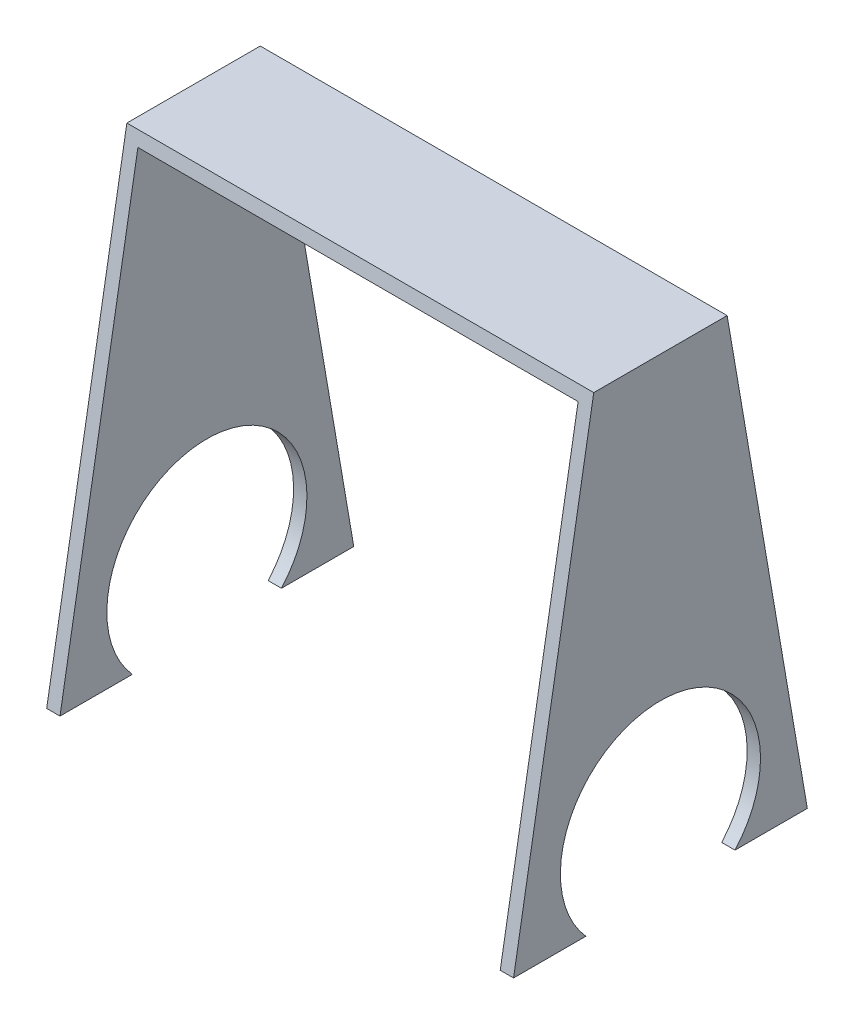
ISO-10303-21;
HEADER;
FILE_DESCRIPTION(('STEP AP214'),'2;1');
FILE_NAME('part.step','',(''),(''),'','','');
FILE_SCHEMA(('AUTOMOTIVE_DESIGN { 1 0 10303 214 1 1 1 1 }'));
ENDSEC;
DATA;
#1=APPLICATION_CONTEXT('core data for automotive mechanical design processes');
#2=APPLICATION_PROTOCOL_DEFINITION('international standard','automotive_design',2000,#1);
#3=PRODUCT_CONTEXT('',#1,'mechanical');
#4=PRODUCT('Part','Part','',(#3));
#5=PRODUCT_RELATED_PRODUCT_CATEGORY('part','',(#4));
#6=PRODUCT_DEFINITION_FORMATION('','',#4);
#7=PRODUCT_DEFINITION_CONTEXT('part definition',#1,'design');
#8=PRODUCT_DEFINITION('design','',#6,#7);
#9=PRODUCT_DEFINITION_SHAPE('','',#8);
#10=(LENGTH_UNIT() NAMED_UNIT(*) SI_UNIT(.MILLI.,.METRE.));
#11=(NAMED_UNIT(*) PLANE_ANGLE_UNIT() SI_UNIT($,.RADIAN.));
#12=(NAMED_UNIT(*) SI_UNIT($,.STERADIAN.) SOLID_ANGLE_UNIT());
#13=UNCERTAINTY_MEASURE_WITH_UNIT(LENGTH_MEASURE(1.E-05),#10,'distance_accuracy_value','');
#14=(GEOMETRIC_REPRESENTATION_CONTEXT(3) GLOBAL_UNCERTAINTY_ASSIGNED_CONTEXT((#13)) GLOBAL_UNIT_ASSIGNED_CONTEXT((#10,
#11,#12)) REPRESENTATION_CONTEXT('',''));
#15=CARTESIAN_POINT('',(0.,0.,0.));
#16=DIRECTION('',(0.,0.,1.));
#17=DIRECTION('',(1.,0.,0.));
#18=AXIS2_PLACEMENT_3D('',#15,#16,#17);
#19=CARTESIAN_POINT('',(-29.8,43.,4.5));
#20=DIRECTION('',(0.,1.,0.));
#21=DIRECTION('',(0.,0.,1.));
#22=AXIS2_PLACEMENT_3D('',#19,#20,#21);
#23=PLANE('',#22);
#24=DIRECTION('',(1.,0.,0.));
#25=VECTOR('',#24,1.);
#26=CARTESIAN_POINT('',(-29.8,43.,4.45211569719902));
#27=LINE('',#26,#25);
#28=CARTESIAN_POINT('',(-30.,43.,4.45211569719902));
#29=VERTEX_POINT('',#28);
#30=CARTESIAN_POINT('',(-29.8,43.,4.45211569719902));
#31=VERTEX_POINT('',#30);
#32=EDGE_CURVE('E192',#29,#31,#27,.T.);
#33=ORIENTED_EDGE('',*,*,#32,.F.);
#34=DIRECTION('',(0.,0.,-1.));
#35=VECTOR('',#34,1.);
#36=CARTESIAN_POINT('',(-30.,43.,4.5));
#37=LINE('',#36,#35);
#38=CARTESIAN_POINT('',(-30.,43.,3.3680339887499));
#39=VERTEX_POINT('',#38);
#40=EDGE_CURVE('E160',#29,#39,#37,.T.);
#41=ORIENTED_EDGE('',*,*,#40,.T.);
#42=DIRECTION('',(1.,0.,0.));
#43=VECTOR('',#42,1.);
#44=CARTESIAN_POINT('',(-30.,43.,3.3680339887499));
#45=LINE('',#44,#43);
#46=CARTESIAN_POINT('',(-29.8,43.,3.3680339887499));
#47=VERTEX_POINT('',#46);
#48=EDGE_CURVE('E138',#39,#47,#45,.T.);
#49=ORIENTED_EDGE('',*,*,#48,.T.);
#50=DIRECTION('',(0.,0.,-1.));
#51=VECTOR('',#50,1.);
#52=CARTESIAN_POINT('',(-29.8,43.,4.5));
#53=LINE('',#52,#51);
#54=EDGE_CURVE('E157',#31,#47,#53,.T.);
#55=ORIENTED_EDGE('',*,*,#54,.F.);
#56=EDGE_LOOP('',(#33,#41,#49,#55));
#57=FACE_BOUND('',#56,.T.);
#58=ADVANCED_FACE('F32',(#57),#23,.F.);
#59=CARTESIAN_POINT('',(-23.,43.,4.5));
#60=DIRECTION('',(0.,1.,0.));
#61=DIRECTION('',(0.,0.,1.));
#62=AXIS2_PLACEMENT_3D('',#59,#60,#61);
#63=PLANE('',#62);
#64=DIRECTION('',(1.,0.,0.));
#65=VECTOR('',#64,1.);
#66=CARTESIAN_POINT('',(-23.,43.,4.45211569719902));
#67=LINE('',#66,#65);
#68=CARTESIAN_POINT('',(-23.2,43.,4.45211569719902));
#69=VERTEX_POINT('',#68);
#70=CARTESIAN_POINT('',(-23.,43.,4.45211569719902));
#71=VERTEX_POINT('',#70);
#72=EDGE_CURVE('E55',#69,#71,#67,.T.);
#73=ORIENTED_EDGE('',*,*,#72,.F.);
#74=DIRECTION('',(0.,0.,-1.));
#75=VECTOR('',#74,1.);
#76=CARTESIAN_POINT('',(-23.2,43.,4.5));
#77=LINE('',#76,#75);
#78=CARTESIAN_POINT('',(-23.2,43.,3.3680339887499));
#79=VERTEX_POINT('',#78);
#80=EDGE_CURVE('E148',#69,#79,#77,.T.);
#81=ORIENTED_EDGE('',*,*,#80,.T.);
#82=DIRECTION('',(1.,0.,0.));
#83=VECTOR('',#82,1.);
#84=CARTESIAN_POINT('',(-30.,43.,3.3680339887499));
#85=LINE('',#84,#83);
#86=CARTESIAN_POINT('',(-23.,43.,3.3680339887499));
#87=VERTEX_POINT('',#86);
#88=EDGE_CURVE('E202',#79,#87,#85,.T.);
#89=ORIENTED_EDGE('',*,*,#88,.T.);
#90=DIRECTION('',(0.,0.,-1.));
#91=VECTOR('',#90,1.);
#92=CARTESIAN_POINT('',(-23.,43.,4.5));
#93=LINE('',#92,#91);
#94=EDGE_CURVE('E140',#71,#87,#93,.T.);
#95=ORIENTED_EDGE('',*,*,#94,.F.);
#96=EDGE_LOOP('',(#73,#81,#89,#95));
#97=FACE_BOUND('',#96,.T.);
#98=ADVANCED_FACE('F237',(#97),#63,.F.);
#99=CARTESIAN_POINT('',(-30.,50.,4.5));
#100=DIRECTION('',(0.,-1.,0.));
#101=DIRECTION('',(0.,0.,-1.));
#102=AXIS2_PLACEMENT_3D('',#99,#100,#101);
#103=PLANE('',#102);
#104=DIRECTION('',(1.,0.,0.));
#105=VECTOR('',#104,1.);
#106=CARTESIAN_POINT('',(-30.,50.,3.25));
#107=LINE('',#106,#105);
#108=CARTESIAN_POINT('',(-30.,50.,3.25));
#109=VERTEX_POINT('',#108);
#110=CARTESIAN_POINT('',(-23.,50.,3.25));
#111=VERTEX_POINT('',#110);
#112=EDGE_CURVE('E121',#109,#111,#107,.T.);
#113=ORIENTED_EDGE('',*,*,#112,.T.);
#114=DIRECTION('',(0.,0.,-1.));
#115=VECTOR('',#114,1.);
#116=CARTESIAN_POINT('',(-23.,50.,4.5));
#117=LINE('',#116,#115);
#118=CARTESIAN_POINT('',(-23.,50.,1.24999999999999));
#119=VERTEX_POINT('',#118);
#120=EDGE_CURVE('E131',#111,#119,#117,.T.);
#121=ORIENTED_EDGE('',*,*,#120,.T.);
#122=DIRECTION('',(1.,0.,0.));
#123=VECTOR('',#122,1.);
#124=CARTESIAN_POINT('',(-30.,50.,1.25));
#125=LINE('',#124,#123);
#126=CARTESIAN_POINT('',(-30.,50.,1.25));
#127=VERTEX_POINT('',#126);
#128=EDGE_CURVE('E47',#127,#119,#125,.T.);
#129=ORIENTED_EDGE('',*,*,#128,.F.);
#130=DIRECTION('',(0.,0.,-1.));
#131=VECTOR('',#130,1.);
#132=CARTESIAN_POINT('',(-30.,50.,4.5));
#133=LINE('',#132,#131);
#134=EDGE_CURVE('E40',#109,#127,#133,.T.);
#135=ORIENTED_EDGE('',*,*,#134,.F.);
#136=EDGE_LOOP('',(#113,#121,#129,#135));
#137=FACE_BOUND('',#136,.T.);
#138=ADVANCED_FACE('F34',(#137),#103,.F.);
#139=CARTESIAN_POINT('',(-30.,50.,4.5));
#140=DIRECTION('',(1.,0.,0.));
#141=DIRECTION('',(0.,0.,-1.));
#142=AXIS2_PLACEMENT_3D('',#139,#140,#141);
#143=PLANE('',#142);
#144=DIRECTION('',(0.,-0.985572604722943,0.169253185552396));
#145=VECTOR('',#144,1.);
#146=CARTESIAN_POINT('',(-30.,50.,3.25));
#147=LINE('',#146,#145);
#148=EDGE_CURVE('E168',#109,#29,#147,.T.);
#149=ORIENTED_EDGE('',*,*,#148,.F.);
#150=ORIENTED_EDGE('',*,*,#134,.T.);
#151=DIRECTION('',(0.,0.985572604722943,0.169253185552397));
#152=VECTOR('',#151,1.);
#153=CARTESIAN_POINT('',(-30.,42.7211665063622,0.));
#154=LINE('',#153,#152);
#155=CARTESIAN_POINT('',(-30.,43.,0.0478843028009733));
#156=VERTEX_POINT('',#155);
#157=EDGE_CURVE('E165',#156,#127,#154,.T.);
#158=ORIENTED_EDGE('',*,*,#157,.F.);
#159=CARTESIAN_POINT('',(-30.,43.,1.1319660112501));
#160=VERTEX_POINT('',#159);
#161=EDGE_CURVE('E159',#160,#156,#37,.T.);
#162=ORIENTED_EDGE('',*,*,#161,.F.);
#163=CARTESIAN_POINT('',(-30.,44.,2.25));
#164=DIRECTION('',(1.,0.,0.));
#165=DIRECTION('',(0.,0.,-1.));
#166=AXIS2_PLACEMENT_3D('',#163,#164,#165);
#167=CIRCLE('',#166,1.5);
#168=EDGE_CURVE('E194',#160,#39,#167,.T.);
#169=ORIENTED_EDGE('',*,*,#168,.T.);
#170=ORIENTED_EDGE('',*,*,#40,.F.);
#171=EDGE_LOOP('',(#149,#150,#158,#162,#169,#170));
#172=FACE_BOUND('',#171,.T.);
#173=ADVANCED_FACE('F163',(#172),#143,.F.);
#174=DIRECTION('',(-1.,0.,0.));
#175=VECTOR('',#174,1.);
#176=CARTESIAN_POINT('',(-29.8,43.,0.0478843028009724));
#177=LINE('',#176,#175);
#178=CARTESIAN_POINT('',(-29.8,43.,0.0478843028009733));
#179=VERTEX_POINT('',#178);
#180=EDGE_CURVE('E183',#179,#156,#177,.T.);
#181=ORIENTED_EDGE('',*,*,#180,.F.);
#182=CARTESIAN_POINT('',(-29.8,43.,1.1319660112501));
#183=VERTEX_POINT('',#182);
#184=EDGE_CURVE('E156',#183,#179,#53,.T.);
#185=ORIENTED_EDGE('',*,*,#184,.F.);
#186=DIRECTION('',(1.,0.,0.));
#187=VECTOR('',#186,1.);
#188=CARTESIAN_POINT('',(-30.,43.,1.1319660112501));
#189=LINE('',#188,#187);
#190=EDGE_CURVE('E143',#183,#160,#189,.F.);
#191=ORIENTED_EDGE('',*,*,#190,.T.);
#192=ORIENTED_EDGE('',*,*,#161,.T.);
#193=EDGE_LOOP('',(#181,#185,#191,#192));
#194=FACE_BOUND('',#193,.T.);
#195=ADVANCED_FACE('F211',(#194),#23,.F.);
#196=CARTESIAN_POINT('',(-29.8,49.8,4.5));
#197=DIRECTION('',(-1.,0.,0.));
#198=DIRECTION('',(0.,0.,1.));
#199=AXIS2_PLACEMENT_3D('',#196,#197,#198);
#200=PLANE('',#199);
#201=DIRECTION('',(0.,0.985572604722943,-0.169253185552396));
#202=VECTOR('',#201,1.);
#203=CARTESIAN_POINT('',(-29.8,49.5972151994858,3.31917056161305));
#204=LINE('',#203,#202);
#205=CARTESIAN_POINT('',(-29.8,49.8,3.28434616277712));
#206=VERTEX_POINT('',#205);
#207=EDGE_CURVE('E189',#31,#206,#204,.T.);
#208=ORIENTED_EDGE('',*,*,#207,.F.);
#209=ORIENTED_EDGE('',*,*,#54,.T.);
#210=CARTESIAN_POINT('',(-29.8,44.,2.25));
#211=DIRECTION('',(-1.,0.,0.));
#212=DIRECTION('',(0.,0.,1.));
#213=AXIS2_PLACEMENT_3D('',#210,#211,#212);
#214=CIRCLE('',#213,1.5);
#215=EDGE_CURVE('E205',#47,#183,#214,.T.);
#216=ORIENTED_EDGE('',*,*,#215,.T.);
#217=ORIENTED_EDGE('',*,*,#184,.T.);
#218=DIRECTION('',(0.,-0.985572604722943,-0.169253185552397));
#219=VECTOR('',#218,1.);
#220=CARTESIAN_POINT('',(-29.8,50.3478660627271,1.3097393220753));
#221=LINE('',#220,#219);
#222=CARTESIAN_POINT('',(-29.8,49.8,1.21565383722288));
#223=VERTEX_POINT('',#222);
#224=EDGE_CURVE('E181',#223,#179,#221,.T.);
#225=ORIENTED_EDGE('',*,*,#224,.F.);
#226=DIRECTION('',(0.,0.,-1.));
#227=VECTOR('',#226,1.);
#228=CARTESIAN_POINT('',(-29.8,49.8,4.5));
#229=LINE('',#228,#227);
#230=EDGE_CURVE('E153',#206,#223,#229,.T.);
#231=ORIENTED_EDGE('',*,*,#230,.F.);
#232=EDGE_LOOP('',(#208,#209,#216,#217,#225,#231));
#233=FACE_BOUND('',#232,.T.);
#234=ADVANCED_FACE('F223',(#233),#200,.F.);
#235=CARTESIAN_POINT('',(-23.2,49.8,4.5));
#236=DIRECTION('',(0.,1.,0.));
#237=DIRECTION('',(-1.,0.,0.));
#238=AXIS2_PLACEMENT_3D('',#235,#236,#237);
#239=PLANE('',#238);
#240=DIRECTION('',(1.,0.,0.));
#241=VECTOR('',#240,1.);
#242=CARTESIAN_POINT('',(-23.2,49.8,3.28434616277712));
#243=LINE('',#242,#241);
#244=CARTESIAN_POINT('',(-23.2,49.8,3.28434616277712));
#245=VERTEX_POINT('',#244);
#246=EDGE_CURVE('E187',#206,#245,#243,.T.);
#247=ORIENTED_EDGE('',*,*,#246,.F.);
#248=ORIENTED_EDGE('',*,*,#230,.T.);
#249=DIRECTION('',(-1.,0.,0.));
#250=VECTOR('',#249,1.);
#251=CARTESIAN_POINT('',(-23.2,49.8,1.21565383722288));
#252=LINE('',#251,#250);
#253=CARTESIAN_POINT('',(-23.2,49.8,1.21565383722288));
#254=VERTEX_POINT('',#253);
#255=EDGE_CURVE('E179',#254,#223,#252,.T.);
#256=ORIENTED_EDGE('',*,*,#255,.F.);
#257=DIRECTION('',(0.,0.,-1.));
#258=VECTOR('',#257,1.);
#259=CARTESIAN_POINT('',(-23.2,49.8,4.5));
#260=LINE('',#259,#258);
#261=EDGE_CURVE('E150',#245,#254,#260,.T.);
#262=ORIENTED_EDGE('',*,*,#261,.F.);
#263=EDGE_LOOP('',(#247,#248,#256,#262));
#264=FACE_BOUND('',#263,.T.);
#265=ADVANCED_FACE('F227',(#264),#239,.F.);
#266=CARTESIAN_POINT('',(-23.2,43.,4.5));
#267=DIRECTION('',(1.,0.,0.));
#268=DIRECTION('',(0.,0.,-1.));
#269=AXIS2_PLACEMENT_3D('',#266,#267,#268);
#270=PLANE('',#269);
#271=DIRECTION('',(0.,-0.985572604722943,0.169253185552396));
#272=VECTOR('',#271,1.);
#273=CARTESIAN_POINT('',(-23.2,42.9920123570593,4.45348742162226));
#274=LINE('',#273,#272);
#275=EDGE_CURVE('E185',#245,#69,#274,.T.);
#276=ORIENTED_EDGE('',*,*,#275,.F.);
#277=ORIENTED_EDGE('',*,*,#261,.T.);
#278=DIRECTION('',(0.,0.985572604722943,0.169253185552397));
#279=VECTOR('',#278,1.);
#280=CARTESIAN_POINT('',(-23.2,43.7426632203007,0.175422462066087));
#281=LINE('',#280,#279);
#282=CARTESIAN_POINT('',(-23.2,43.,0.0478843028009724));
#283=VERTEX_POINT('',#282);
#284=EDGE_CURVE('E177',#283,#254,#281,.T.);
#285=ORIENTED_EDGE('',*,*,#284,.F.);
#286=CARTESIAN_POINT('',(-23.2,43.,1.1319660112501));
#287=VERTEX_POINT('',#286);
#288=EDGE_CURVE('E147',#287,#283,#77,.T.);
#289=ORIENTED_EDGE('',*,*,#288,.F.);
#290=CARTESIAN_POINT('',(-23.2,44.,2.25));
#291=DIRECTION('',(1.,0.,0.));
#292=DIRECTION('',(0.,0.,-1.));
#293=AXIS2_PLACEMENT_3D('',#290,#291,#292);
#294=CIRCLE('',#293,1.5);
#295=EDGE_CURVE('E199',#287,#79,#294,.T.);
#296=ORIENTED_EDGE('',*,*,#295,.T.);
#297=ORIENTED_EDGE('',*,*,#80,.F.);
#298=EDGE_LOOP('',(#276,#277,#285,#289,#296,#297));
#299=FACE_BOUND('',#298,.T.);
#300=ADVANCED_FACE('F232',(#299),#270,.F.);
#301=DIRECTION('',(-1.,0.,0.));
#302=VECTOR('',#301,1.);
#303=CARTESIAN_POINT('',(-23.,43.,0.0478843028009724));
#304=LINE('',#303,#302);
#305=CARTESIAN_POINT('',(-23.,43.,0.0478843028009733));
#306=VERTEX_POINT('',#305);
#307=EDGE_CURVE('E133',#306,#283,#304,.T.);
#308=ORIENTED_EDGE('',*,*,#307,.F.);
#309=CARTESIAN_POINT('',(-23.,43.,1.1319660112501));
#310=VERTEX_POINT('',#309);
#311=EDGE_CURVE('E137',#310,#306,#93,.T.);
#312=ORIENTED_EDGE('',*,*,#311,.F.);
#313=DIRECTION('',(1.,0.,0.));
#314=VECTOR('',#313,1.);
#315=CARTESIAN_POINT('',(-30.,43.,1.1319660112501));
#316=LINE('',#315,#314);
#317=EDGE_CURVE('E196',#310,#287,#316,.F.);
#318=ORIENTED_EDGE('',*,*,#317,.T.);
#319=ORIENTED_EDGE('',*,*,#288,.T.);
#320=EDGE_LOOP('',(#308,#312,#318,#319));
#321=FACE_BOUND('',#320,.T.);
#322=ADVANCED_FACE('F244',(#321),#63,.F.);
#323=CARTESIAN_POINT('',(-23.,50.,4.5));
#324=DIRECTION('',(-1.,0.,0.));
#325=DIRECTION('',(0.,0.,1.));
#326=AXIS2_PLACEMENT_3D('',#323,#324,#325);
#327=PLANE('',#326);
#328=DIRECTION('',(0.,-0.985572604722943,0.169253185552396));
#329=VECTOR('',#328,1.);
#330=CARTESIAN_POINT('',(-23.,50.,3.25));
#331=LINE('',#330,#329);
#332=EDGE_CURVE('E118',#111,#71,#331,.T.);
#333=ORIENTED_EDGE('',*,*,#332,.T.);
#334=ORIENTED_EDGE('',*,*,#94,.T.);
#335=CARTESIAN_POINT('',(-23.,44.,2.25));
#336=DIRECTION('',(-1.,0.,0.));
#337=DIRECTION('',(0.,0.,1.));
#338=AXIS2_PLACEMENT_3D('',#335,#336,#337);
#339=CIRCLE('',#338,1.5);
#340=EDGE_CURVE('E11',#87,#310,#339,.T.);
#341=ORIENTED_EDGE('',*,*,#340,.T.);
#342=ORIENTED_EDGE('',*,*,#311,.T.);
#343=DIRECTION('',(0.,0.985572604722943,0.169253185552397));
#344=VECTOR('',#343,1.);
#345=CARTESIAN_POINT('',(-23.,42.7211665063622,0.));
#346=LINE('',#345,#344);
#347=EDGE_CURVE('E126',#306,#119,#346,.T.);
#348=ORIENTED_EDGE('',*,*,#347,.T.);
#349=ORIENTED_EDGE('',*,*,#120,.F.);
#350=EDGE_LOOP('',(#333,#334,#341,#342,#348,#349));
#351=FACE_BOUND('',#350,.T.);
#352=ADVANCED_FACE('F135',(#351),#327,.F.);
#353=CARTESIAN_POINT('',(-30.,44.,2.25));
#354=DIRECTION('',(1.,0.,0.));
#355=DIRECTION('',(0.,0.,-1.));
#356=AXIS2_PLACEMENT_3D('',#353,#354,#355);
#357=CYLINDRICAL_SURFACE('',#356,1.5);
#358=ORIENTED_EDGE('',*,*,#295,.F.);
#359=ORIENTED_EDGE('',*,*,#317,.F.);
#360=ORIENTED_EDGE('',*,*,#340,.F.);
#361=ORIENTED_EDGE('',*,*,#88,.F.);
#362=EDGE_LOOP('',(#358,#359,#360,#361));
#363=FACE_BOUND('',#362,.T.);
#364=ADVANCED_FACE('F240',(#363),#357,.F.);
#365=ORIENTED_EDGE('',*,*,#168,.F.);
#366=ORIENTED_EDGE('',*,*,#190,.F.);
#367=ORIENTED_EDGE('',*,*,#215,.F.);
#368=ORIENTED_EDGE('',*,*,#48,.F.);
#369=EDGE_LOOP('',(#365,#366,#367,#368));
#370=FACE_BOUND('',#369,.T.);
#371=ADVANCED_FACE('F216',(#370),#357,.F.);
#372=CARTESIAN_POINT('',(-30.,42.7211665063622,0.));
#373=DIRECTION('',(0.,0.169253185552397,-0.985572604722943));
#374=DIRECTION('',(0.,0.985572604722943,0.169253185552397));
#375=AXIS2_PLACEMENT_3D('',#372,#373,#374);
#376=PLANE('',#375);
#377=ORIENTED_EDGE('',*,*,#180,.T.);
#378=ORIENTED_EDGE('',*,*,#157,.T.);
#379=ORIENTED_EDGE('',*,*,#128,.T.);
#380=ORIENTED_EDGE('',*,*,#347,.F.);
#381=ORIENTED_EDGE('',*,*,#307,.T.);
#382=ORIENTED_EDGE('',*,*,#284,.T.);
#383=ORIENTED_EDGE('',*,*,#255,.T.);
#384=ORIENTED_EDGE('',*,*,#224,.T.);
#385=EDGE_LOOP('',(#377,#378,#379,#380,#381,#382,#383,#384));
#386=FACE_BOUND('',#385,.T.);
#387=ADVANCED_FACE('F246',(#386),#376,.T.);
#388=CARTESIAN_POINT('',(-30.,50.,3.25));
#389=DIRECTION('',(0.,0.169253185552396,0.985572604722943));
#390=DIRECTION('',(0.,-0.985572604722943,0.169253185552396));
#391=AXIS2_PLACEMENT_3D('',#388,#389,#390);
#392=PLANE('',#391);
#393=ORIENTED_EDGE('',*,*,#32,.T.);
#394=ORIENTED_EDGE('',*,*,#207,.T.);
#395=ORIENTED_EDGE('',*,*,#246,.T.);
#396=ORIENTED_EDGE('',*,*,#275,.T.);
#397=ORIENTED_EDGE('',*,*,#72,.T.);
#398=ORIENTED_EDGE('',*,*,#332,.F.);
#399=ORIENTED_EDGE('',*,*,#112,.F.);
#400=ORIENTED_EDGE('',*,*,#148,.T.);
#401=EDGE_LOOP('',(#393,#394,#395,#396,#397,#398,#399,#400));
#402=FACE_BOUND('',#401,.T.);
#403=ADVANCED_FACE('F120',(#402),#392,.T.);
#404=CLOSED_SHELL('',(#58,#98,#138,#173,#195,#234,#265,#300,#322,#352,#364,#371,#387,#403));
#405=MANIFOLD_SOLID_BREP('B2',#404);
#406=ADVANCED_BREP_SHAPE_REPRESENTATION('',(#18,#405),#14);
#407=SHAPE_DEFINITION_REPRESENTATION(#9,#406);
ENDSEC;
END-ISO-10303-21;
